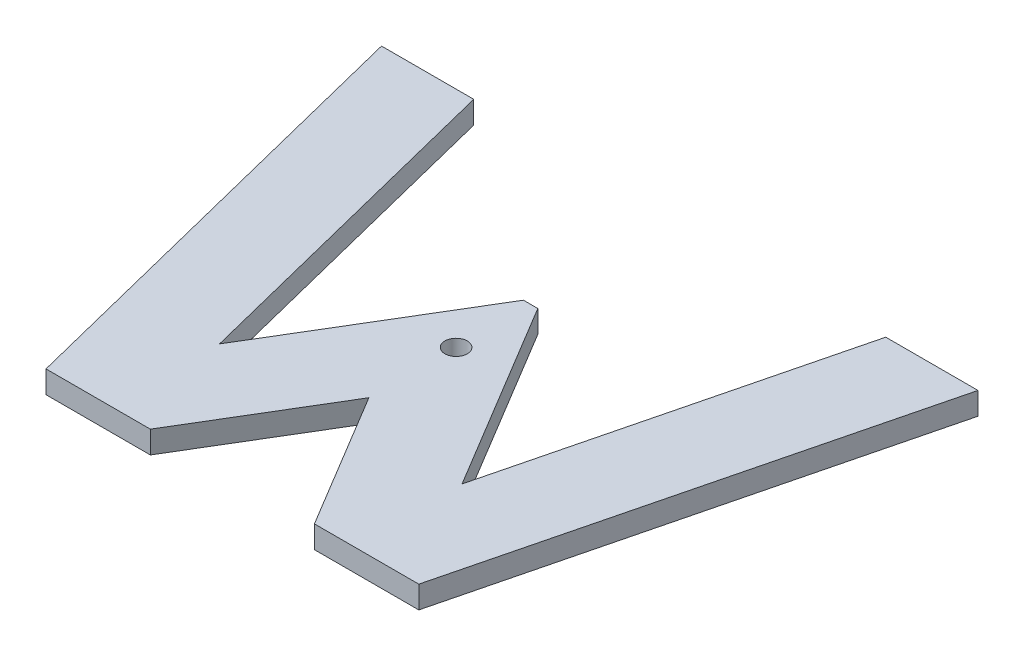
from build123d import *

# Parameters (mm, degrees)
SKETCH1_R      = 1.5
EXTRUDE1_DEPTH = 3


with BuildPart() as part:
    # Sketch1 → Extrude1 (new body)
    with BuildSketch(Plane(origin=(0, 0, 0), x_dir=(1, 0, 0), z_dir=(0, 1, 0))):
        Polygon((12.369316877, 60), (23.735238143, 14.536314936), (39.037008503, 40), (40.962991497, 40), (56.264761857, 14.536314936), (67.630683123, 60), (80, 60), (65, 0), (51, 0), (40, 18.305106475), (29, 0), (15, 0), (0, 60), align=None)
        with Locations(Location((40, 30, 0), (0, 0, 270))):
            Circle(SKETCH1_R, mode=Mode.SUBTRACT)
    extrude(amount=EXTRUDE1_DEPTH)


solid = part.part
